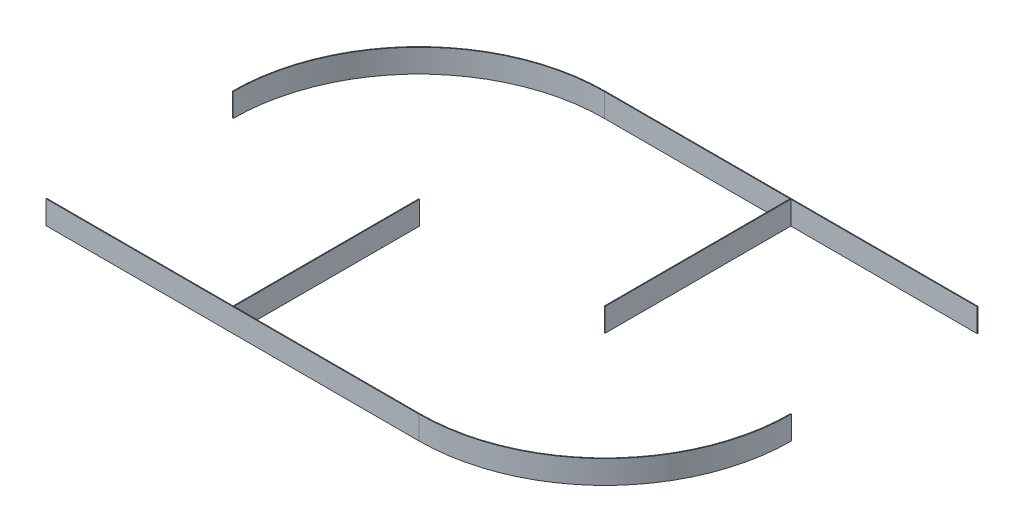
from build123d import *

# Parameters (mm, degrees)
EXTRUDE_THIN1_DEPTH   = 76.2
EXTRUDE_THIN1_2_DEPTH = 76.2
SKETCH1_W             = 2.54
SKETCH1_H             = 609.6
EXTRUDE_THIN1_3_DEPTH = 76.2
EXTRUDE_THIN1_4_DEPTH = 76.2


with BuildPart() as part:
    # Sketch1 → Extrude-Thin1 (new body)
    with BuildSketch(Plane(origin=(0, 0, 0), x_dir=(1, 0, 0), z_dir=(0, 1, 0))):
        with BuildLine():
            ThreePointArc((914.4, 0), (735.852293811, -431.052293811), (304.8, -609.6))
            Line((304.8, -609.6), (-914.4, -609.6))
            Line((-914.4, -609.6), (-914.4, -607.06))
            Line((-914.4, -607.06), (304.8, -607.06))
            ThreePointArc((304.8, -607.06), (734.056242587, -429.256242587), (911.86, 0))
            Line((911.86, 0), (914.4, 0))
        make_face()
    extrude(amount=EXTRUDE_THIN1_DEPTH)


with BuildPart() as body_2:
    # Sketch1 → Extrude-Thin1 2 (new body)
    with BuildSketch(Plane(origin=(0, 0, 0), x_dir=(1, 0, 0), z_dir=(0, 1, 0))):
        with BuildLine():
            ThreePointArc((-914.4, 0), (-735.852293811, 431.052293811), (-304.8, 609.6))
            Line((-304.8, 609.6), (914.4, 609.6))
            Line((914.4, 609.6), (914.4, 607.06))
            Line((914.4, 607.06), (-304.8, 607.06))
            ThreePointArc((-304.8, 607.06), (-734.056242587, 429.256242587), (-911.86, 0))
            Line((-911.86, 0), (-914.4, 0))
        make_face()
    extrude(amount=EXTRUDE_THIN1_2_DEPTH)


with BuildPart() as body_3:
    # Sketch1 → Extrude-Thin1 3 (new body)
    with BuildSketch(Plane(origin=(0, 0, 0), x_dir=(1, 0, 0), z_dir=(0, 1, 0))):
        with Locations((303.53, 304.8)):
            Rectangle(SKETCH1_W, SKETCH1_H)
    extrude(amount=EXTRUDE_THIN1_3_DEPTH)


with BuildPart() as body_4:
    # Sketch1 → Extrude-Thin1 4 (new body)
    with BuildSketch(Plane(origin=(0, 0, 0), x_dir=(1, 0, 0), z_dir=(0, 1, 0))):
        with Locations((-303.53, -304.8)):
            Rectangle(SKETCH1_W, SKETCH1_H)
    extrude(amount=EXTRUDE_THIN1_4_DEPTH)


solid = Compound([part.part, body_2.part, body_3.part, body_4.part])
